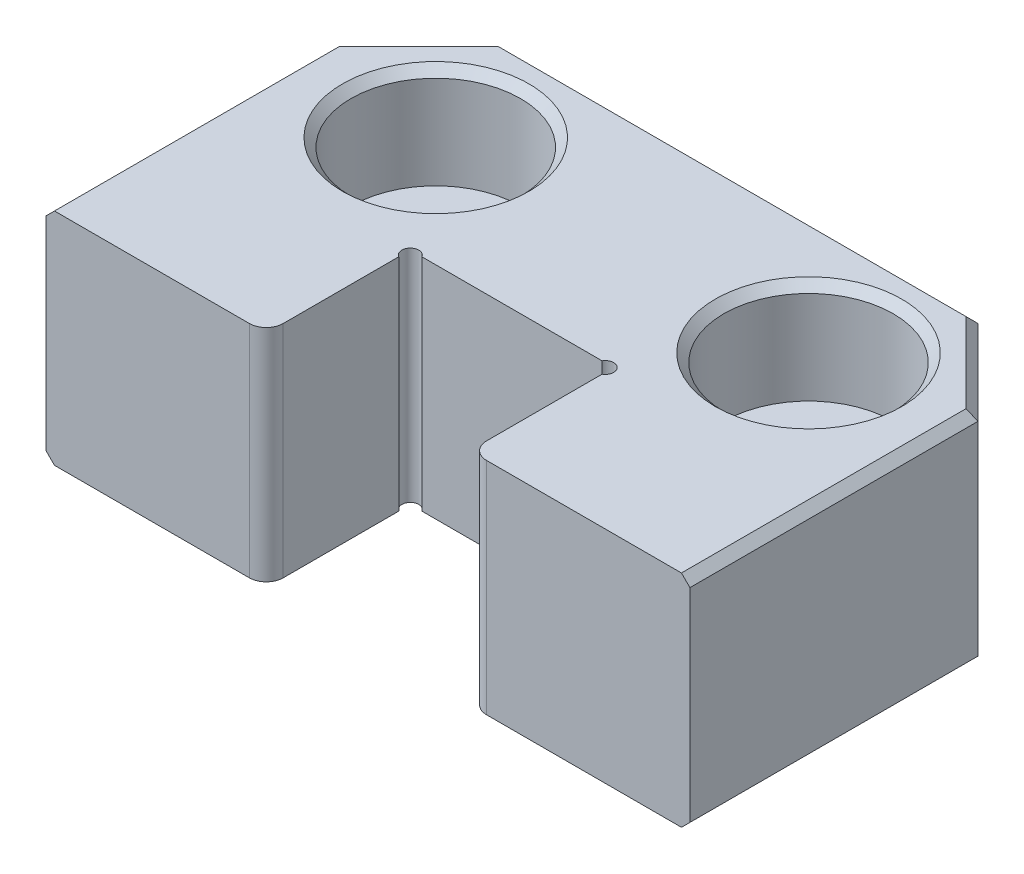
from build123d import *

# Parameters (mm, degrees)
SKETCH2_R          = 2.9
EXTRUDE1_DEPTH     = 13
CHAMFER1_SIZE      = 5
FILLET1_R          = 1
SKETCH3_R          = 5
CUT_EXTRUDE1_DEPTH = 6
CHAMFER2_SIZE      = 0.5
CHAMFER3_SIZE      = 0.5


with BuildPart() as part:
    # Sketch2 → Extrude1 (new body)
    with BuildSketch(Plane(origin=(0, 0, 0), x_dir=(1, 0, 0), z_dir=(0, 1, 0))):
        with BuildLine():
            Line((-19, 22), (19, 22))
            Line((19, 22), (19, 0))
            Line((19, 0), (6, 0))
            Line((6, 0), (6, 7.816987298))
            ThreePointArc((6, 7.816987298), (6.103553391, 8.603553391), (5.316987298, 8.5))
            Line((5.316987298, 8.5), (-5.316987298, 8.5))
            ThreePointArc((-5.316987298, 8.5), (-6.103553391, 8.603553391), (-6, 7.816987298))
            Line((-6, 7.816987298), (-6, 0))
            Line((-6, 0), (-19, 0))
            Line((-19, 0), (-19, 22))
        make_face()
        with Locations(Location((11, 15, 0), (0, 0, 270))):
            Circle(SKETCH2_R, mode=Mode.SUBTRACT)
        with Locations(Location((-11, 15, 0), (0, 0, 270))):
            Circle(SKETCH2_R, mode=Mode.SUBTRACT)
    extrude(amount=-EXTRUDE1_DEPTH)

    # Chamfer1
    chamfer1_edges = [part.edges().sort_by_distance(p)[0] for p in [
        (-19, -6.5, -22),
        (19, -6.5, -22),
    ]]
    chamfer(chamfer1_edges, length=CHAMFER1_SIZE)

    # Fillet1
    fillet1_edges = [part.edges().sort_by_distance(p)[0] for p in [
        (6, -6.5, 0),
        (-6, -6.5, 0),
    ]]
    fillet(fillet1_edges, radius=FILLET1_R)

    # Sketch3 → Cut-Extrude1 (cut)
    with BuildSketch(Plane(origin=(0, 0, 0), x_dir=(1, 0, 0), z_dir=(0, 1, 0))):
        with Locations(Location((-11, 15, 0), (0, 0, 270))):
            Circle(SKETCH3_R)
    cut_extrude1 = extrude(amount=-CUT_EXTRUDE1_DEPTH, mode=Mode.SUBTRACT)

    # Mirror1: Cut-Extrude1 across plane
    add(cut_extrude1.mirror(Plane(origin=(0, 0, 0), x_dir=(0, 0, 1), z_dir=(1, 0, 0))), mode=Mode.SUBTRACT)

    # Chamfer2
    chamfer2_edges = [part.edges().sort_by_distance(p)[0] for p in [
        (19, -13, -8.5),
        (0, 0, -22),
        (0, -13, -22),
        (-19, 0, -8.5),
        (16.5, 0, -19.5),
        (-16.5, 0, -19.5),
        (-19, -13, -8.5),
        (16.5, -13, -19.5),
        (-16.5, -13, -19.5),
        (19, 0, -8.5),
    ]]
    chamfer(chamfer2_edges, length=CHAMFER2_SIZE)

    # Chamfer3
    chamfer3_edges = [part.edges().sort_by_distance(p)[0] for p in [
        (-11, 0, -20),
        (11, 0, -20),
    ]]
    chamfer(chamfer3_edges, length=CHAMFER3_SIZE)


solid = part.part
